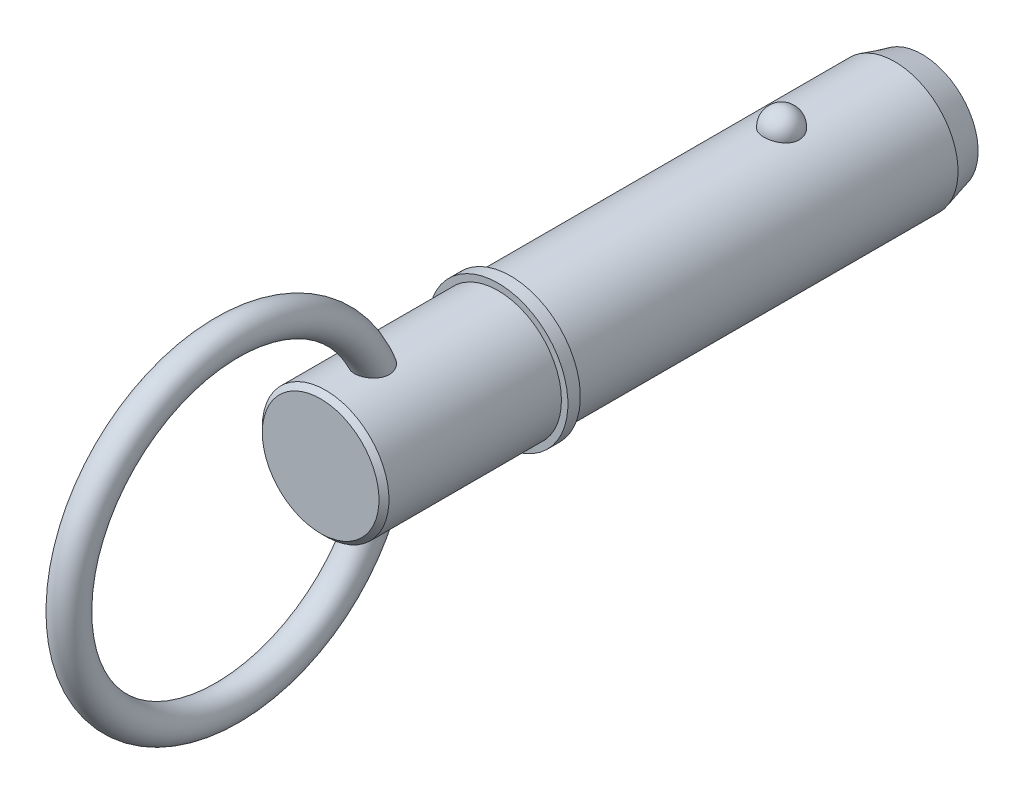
ISO-10303-21;
HEADER;
FILE_DESCRIPTION(('STEP AP214'),'2;1');
FILE_NAME('part.step','',(''),(''),'','','');
FILE_SCHEMA(('AUTOMOTIVE_DESIGN { 1 0 10303 214 1 1 1 1 }'));
ENDSEC;
DATA;
#1=APPLICATION_CONTEXT('core data for automotive mechanical design processes');
#2=APPLICATION_PROTOCOL_DEFINITION('international standard','automotive_design',2000,#1);
#3=PRODUCT_CONTEXT('',#1,'mechanical');
#4=PRODUCT('Part','Part','',(#3));
#5=PRODUCT_RELATED_PRODUCT_CATEGORY('part','',(#4));
#6=PRODUCT_DEFINITION_FORMATION('','',#4);
#7=PRODUCT_DEFINITION_CONTEXT('part definition',#1,'design');
#8=PRODUCT_DEFINITION('design','',#6,#7);
#9=PRODUCT_DEFINITION_SHAPE('','',#8);
#10=(LENGTH_UNIT() NAMED_UNIT(*) SI_UNIT(.MILLI.,.METRE.));
#11=(NAMED_UNIT(*) PLANE_ANGLE_UNIT() SI_UNIT($,.RADIAN.));
#12=(NAMED_UNIT(*) SI_UNIT($,.STERADIAN.) SOLID_ANGLE_UNIT());
#13=UNCERTAINTY_MEASURE_WITH_UNIT(LENGTH_MEASURE(1.E-05),#10,'distance_accuracy_value','');
#14=(GEOMETRIC_REPRESENTATION_CONTEXT(3) GLOBAL_UNCERTAINTY_ASSIGNED_CONTEXT((#13)) GLOBAL_UNIT_ASSIGNED_CONTEXT((#10,
#11,#12)) REPRESENTATION_CONTEXT('',''));
#15=CARTESIAN_POINT('',(0.,0.,0.));
#16=DIRECTION('',(0.,0.,1.));
#17=DIRECTION('',(1.,0.,0.));
#18=AXIS2_PLACEMENT_3D('',#15,#16,#17);
#19=CARTESIAN_POINT('',(0.,0.,50.8));
#20=DIRECTION('',(0.,0.,-1.));
#21=DIRECTION('',(-1.,0.,0.));
#22=AXIS2_PLACEMENT_3D('',#19,#20,#21);
#23=CYLINDRICAL_SURFACE('',#22,12.7);
#24=CARTESIAN_POINT('',(3.52486003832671,12.2010393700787,-3.56));
#25=CARTESIAN_POINT('',(3.52485671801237,12.2010422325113,-3.3610062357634));
#26=CARTESIAN_POINT('',(3.50863187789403,12.2057632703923,-3.16197042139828));
#27=CARTESIAN_POINT('',(3.4441205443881,12.2241207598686,-2.76953945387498));
#28=CARTESIAN_POINT('',(3.39582213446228,12.2377605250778,-2.57614642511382));
#29=CARTESIAN_POINT('',(3.26839193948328,12.2724057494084,-2.20059799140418));
#30=CARTESIAN_POINT('',(3.18927369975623,12.2934079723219,-2.01843769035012));
#31=CARTESIAN_POINT('',(3.00217139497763,12.3404306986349,-1.6703228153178));
#32=CARTESIAN_POINT('',(2.89418796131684,12.3664510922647,-1.50436788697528));
#33=CARTESIAN_POINT('',(2.65144862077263,12.4207616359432,-1.19241975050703));
#34=CARTESIAN_POINT('',(2.51656310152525,12.4490623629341,-1.04652919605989));
#35=CARTESIAN_POINT('',(2.22383249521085,12.5046678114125,-0.779711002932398));
#36=CARTESIAN_POINT('',(2.0659873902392,12.5319725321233,-0.658783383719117));
#37=CARTESIAN_POINT('',(1.73204520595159,12.5824645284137,-0.445586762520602));
#38=CARTESIAN_POINT('',(1.55600183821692,12.6056634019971,-0.353236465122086));
#39=CARTESIAN_POINT('',(1.19021695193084,12.6454411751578,-0.199381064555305));
#40=CARTESIAN_POINT('',(1.00047694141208,12.6620208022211,-0.137872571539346));
#41=CARTESIAN_POINT('',(0.616329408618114,12.6864692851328,-0.0483191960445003));
#42=CARTESIAN_POINT('',(0.422067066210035,12.6944893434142,-0.0196927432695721));
#43=CARTESIAN_POINT('',(0.0313259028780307,12.7014637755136,0.00524116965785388));
#44=CARTESIAN_POINT('',(-0.165152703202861,12.7004190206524,0.00155173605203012));
#45=CARTESIAN_POINT('',(-0.551780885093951,12.6894611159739,-0.0377454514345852));
#46=CARTESIAN_POINT('',(-0.74198078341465,12.6796749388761,-0.0728962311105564));
#47=CARTESIAN_POINT('',(-1.11361063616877,12.6524544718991,-0.173489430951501));
#48=CARTESIAN_POINT('',(-1.29504043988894,12.6350200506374,-0.238932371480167));
#49=CARTESIAN_POINT('',(-1.64521311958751,12.5942270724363,-0.398772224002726));
#50=CARTESIAN_POINT('',(-1.81387645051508,12.5708347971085,-0.493334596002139));
#51=CARTESIAN_POINT('',(-2.13292959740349,12.5206522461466,-0.708731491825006));
#52=CARTESIAN_POINT('',(-2.28331755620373,12.4938616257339,-0.829568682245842));
#53=CARTESIAN_POINT('',(-2.56470285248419,12.4391828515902,-1.0968714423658));
#54=CARTESIAN_POINT('',(-2.69527522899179,12.4112835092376,-1.24378221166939));
#55=CARTESIAN_POINT('',(-2.93023079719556,12.3579248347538,-1.55763192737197));
#56=CARTESIAN_POINT('',(-3.03461212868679,12.3324656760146,-1.72457229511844));
#57=CARTESIAN_POINT('',(-3.21564423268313,12.2865167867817,-2.07598316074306));
#58=CARTESIAN_POINT('',(-3.29196222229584,12.2660875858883,-2.26063321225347));
#59=CARTESIAN_POINT('',(-3.41323771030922,12.2328979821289,-2.64061334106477));
#60=CARTESIAN_POINT('',(-3.45819611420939,12.2201373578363,-2.83594310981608));
#61=CARTESIAN_POINT('',(-3.51550038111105,12.2037762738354,-3.2308649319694));
#62=CARTESIAN_POINT('',(-3.5279827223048,12.200137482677,-3.43043558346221));
#63=CARTESIAN_POINT('',(-3.52041430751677,12.2023234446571,-3.8289025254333));
#64=CARTESIAN_POINT('',(-3.50036443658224,12.2081479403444,-4.02779883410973));
#65=CARTESIAN_POINT('',(-3.42842010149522,12.2285446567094,-4.41824213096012));
#66=CARTESIAN_POINT('',(-3.37668525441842,12.243073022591,-4.6098208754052));
#67=CARTESIAN_POINT('',(-3.24279085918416,12.2792134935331,-4.98132360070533));
#68=CARTESIAN_POINT('',(-3.16063009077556,12.300825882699,-5.16124711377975));
#69=CARTESIAN_POINT('',(-2.96738224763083,12.3488691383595,-5.50542856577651));
#70=CARTESIAN_POINT('',(-2.85613997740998,12.3753256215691,-5.66959579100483));
#71=CARTESIAN_POINT('',(-2.60773241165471,12.4300386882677,-5.97665065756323));
#72=CARTESIAN_POINT('',(-2.47056612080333,12.458295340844,-6.11953748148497));
#73=CARTESIAN_POINT('',(-2.17327999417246,12.5135827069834,-6.38059312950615));
#74=CARTESIAN_POINT('',(-2.01307652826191,12.5406084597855,-6.49866785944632));
#75=CARTESIAN_POINT('',(-1.67442544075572,12.5902954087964,-6.70609314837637));
#76=CARTESIAN_POINT('',(-1.49597909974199,12.6129569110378,-6.79544572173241));
#77=CARTESIAN_POINT('',(-1.12819666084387,12.6511224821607,-6.94192787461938));
#78=CARTESIAN_POINT('',(-0.93902400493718,12.666712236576,-6.99944518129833));
#79=CARTESIAN_POINT('',(-0.553267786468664,12.6894125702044,-7.08227444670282));
#80=CARTESIAN_POINT('',(-0.356685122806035,12.6965241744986,-7.10759029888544));
#81=CARTESIAN_POINT('',(0.0343320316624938,12.7014305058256,-7.12510946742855));
#82=CARTESIAN_POINT('',(0.228736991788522,12.6993986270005,-7.11792901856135));
#83=CARTESIAN_POINT('',(0.613493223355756,12.6866339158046,-7.07206766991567));
#84=CARTESIAN_POINT('',(0.803844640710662,12.6759013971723,-7.03338790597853));
#85=CARTESIAN_POINT('',(1.17440741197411,12.6469443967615,-6.925834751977));
#86=CARTESIAN_POINT('',(1.35465462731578,12.6287486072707,-6.85707692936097));
#87=CARTESIAN_POINT('',(1.70092526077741,12.5867908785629,-6.69128257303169));
#88=CARTESIAN_POINT('',(1.86694777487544,12.5630285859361,-6.59424424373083));
#89=CARTESIAN_POINT('',(2.18289085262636,12.5120350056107,-6.3727748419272));
#90=CARTESIAN_POINT('',(2.33252391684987,12.4847559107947,-6.24794475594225));
#91=CARTESIAN_POINT('',(2.60889724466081,12.4299457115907,-5.97511730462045));
#92=CARTESIAN_POINT('',(2.73563353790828,12.4024145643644,-5.82711592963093));
#93=CARTESIAN_POINT('',(2.96505559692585,12.3495984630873,-5.5091226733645));
#94=CARTESIAN_POINT('',(3.06728335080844,12.3243610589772,-5.33879227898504));
#95=CARTESIAN_POINT('',(3.24218794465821,12.2795120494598,-4.98295005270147));
#96=CARTESIAN_POINT('',(3.31487538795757,12.2598984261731,-4.79744369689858));
#97=CARTESIAN_POINT('',(3.42255689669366,12.2302435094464,-4.43775244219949));
#98=CARTESIAN_POINT('',(3.46085292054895,12.2193780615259,-4.264615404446));
#99=CARTESIAN_POINT('',(3.5120056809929,12.2047747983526,-3.9143299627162));
#100=CARTESIAN_POINT('',(3.52486299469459,12.2010368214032,-3.73718164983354));
#101=CARTESIAN_POINT('',(3.52486003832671,12.2010393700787,-3.56));
#102=B_SPLINE_CURVE_WITH_KNOTS('',3,(#24,#25,#26,#27,#28,#29,#30,#31,#32,#33,#34,#35,#36,#37,
#38,#39,#40,#41,#42,#43,#44,#45,#46,#47,#48,#49,#50,#51,#52,#53,#54,#55,#56,#57,#58,#59,#60,#61,
#62,#63,#64,#65,#66,#67,#68,#69,#70,#71,#72,#73,#74,#75,#76,#77,#78,#79,#80,#81,#82,#83,#84,#85,
#86,#87,#88,#89,#90,#91,#92,#93,#94,#95,#96,#97,#98,#99,#100,#101),.UNSPECIFIED.,.T.,.F.,(4,2,2,
2,2,2,2,2,2,2,2,2,2,2,2,2,2,2,2,2,2,2,2,2,2,2,2,2,2,2,2,2,2,2,2,2,2,2,4),(0.,0.596344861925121,
1.19291141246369,1.78921606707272,2.38550767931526,2.98474477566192,3.58398233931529,
4.18149920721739,4.77895038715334,5.36566361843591,5.95232045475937,6.53059198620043,
7.10887345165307,7.6905033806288,8.27219236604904,8.86498552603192,9.45782077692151,
10.0574751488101,10.6571122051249,11.2542252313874,11.8513220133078,12.4454353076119,
13.0395724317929,13.636947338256,14.2343451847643,14.8339691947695,15.4335511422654,
16.0256602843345,16.6176978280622,17.1985559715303,17.7793931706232,18.3580179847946,
18.9366795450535,19.5242567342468,20.1119357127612,20.7098642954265,21.3075780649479,
21.8385683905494,22.3695466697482),.UNSPECIFIED.);
#103=CARTESIAN_POINT('',(3.52486003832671,12.2010393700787,-3.56));
#104=VERTEX_POINT('',#103);
#105=EDGE_CURVE('E102',#104,#104,#102,.T.);
#106=ORIENTED_EDGE('',*,*,#105,.T.);
#107=EDGE_LOOP('',(#106));
#108=FACE_BOUND('',#107,.T.);
#109=CARTESIAN_POINT('',(0.,0.,-26.2499999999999));
#110=DIRECTION('',(0.,0.,-1.));
#111=DIRECTION('',(-1.,0.,0.));
#112=AXIS2_PLACEMENT_3D('',#109,#110,#111);
#113=CIRCLE('',#112,12.7);
#114=CARTESIAN_POINT('',(-12.7,0.,-26.2499999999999));
#115=VERTEX_POINT('',#114);
#116=EDGE_CURVE('E110',#115,#115,#113,.F.);
#117=ORIENTED_EDGE('',*,*,#116,.T.);
#118=EDGE_LOOP('',(#117));
#119=FACE_BOUND('',#118,.T.);
#120=CARTESIAN_POINT('',(0.,0.,50.8));
#121=DIRECTION('',(0.,0.,1.));
#122=DIRECTION('',(1.,0.,0.));
#123=AXIS2_PLACEMENT_3D('',#120,#121,#122);
#124=CIRCLE('',#123,12.7);
#125=CARTESIAN_POINT('',(12.7,0.,50.8));
#126=VERTEX_POINT('',#125);
#127=EDGE_CURVE('E108',#126,#126,#124,.T.);
#128=ORIENTED_EDGE('',*,*,#127,.F.);
#129=EDGE_LOOP('',(#128));
#130=FACE_BOUND('',#129,.T.);
#131=ADVANCED_FACE('F39',(#108,#119,#130),#23,.T.);
#132=CARTESIAN_POINT('',(0.,0.,-31.75));
#133=DIRECTION('',(0.,0.,-1.));
#134=DIRECTION('',(-1.,0.,0.));
#135=AXIS2_PLACEMENT_3D('',#132,#133,#134);
#136=PLANE('',#135);
#137=CARTESIAN_POINT('',(0.,0.,-31.75));
#138=DIRECTION('',(0.,0.,-1.));
#139=DIRECTION('',(-1.,0.,0.));
#140=AXIS2_PLACEMENT_3D('',#137,#138,#139);
#141=CIRCLE('',#140,11.2262794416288);
#142=CARTESIAN_POINT('',(-11.2262794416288,0.,-31.75));
#143=VERTEX_POINT('',#142);
#144=EDGE_CURVE('E142',#143,#143,#141,.T.);
#145=ORIENTED_EDGE('',*,*,#144,.T.);
#146=EDGE_LOOP('',(#145));
#147=FACE_BOUND('',#146,.T.);
#148=ADVANCED_FACE('F88',(#147),#136,.T.);
#149=CARTESIAN_POINT('',(0.,0.,-31.75));
#150=DIRECTION('',(0.,0.,1.));
#151=DIRECTION('',(1.,0.,0.));
#152=AXIS2_PLACEMENT_3D('',#149,#150,#151);
#153=CONICAL_SURFACE('',#152,11.2262794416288,0.261799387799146);
#154=ORIENTED_EDGE('',*,*,#116,.F.);
#155=EDGE_LOOP('',(#154));
#156=FACE_BOUND('',#155,.T.);
#157=ORIENTED_EDGE('',*,*,#144,.F.);
#158=EDGE_LOOP('',(#157));
#159=FACE_BOUND('',#158,.T.);
#160=ADVANCED_FACE('F94',(#156,#159),#153,.T.);
#161=CARTESIAN_POINT('',(0.,12.7,-3.56));
#162=DIRECTION('',(0.,1.,0.));
#163=DIRECTION('',(0.,0.,1.));
#164=AXIS2_PLACEMENT_3D('',#161,#162,#163);
#165=SPHERICAL_SURFACE('',#164,3.56);
#166=ORIENTED_EDGE('',*,*,#105,.F.);
#167=EDGE_LOOP('',(#166));
#168=FACE_BOUND('',#167,.T.);
#169=ADVANCED_FACE('F113',(#168),#165,.T.);
#170=CARTESIAN_POINT('',(0.,0.,50.8));
#171=DIRECTION('',(0.,0.,-1.));
#172=DIRECTION('',(-1.,0.,0.));
#173=AXIS2_PLACEMENT_3D('',#170,#171,#172);
#174=PLANE('',#173);
#175=ORIENTED_EDGE('',*,*,#127,.T.);
#176=EDGE_LOOP('',(#175));
#177=FACE_BOUND('',#176,.T.);
#178=CARTESIAN_POINT('',(0.,0.,50.8));
#179=DIRECTION('',(0.,0.,-1.));
#180=DIRECTION('',(-1.,0.,0.));
#181=AXIS2_PLACEMENT_3D('',#178,#179,#180);
#182=CIRCLE('',#181,14.);
#183=CARTESIAN_POINT('',(-14.,0.,50.8));
#184=VERTEX_POINT('',#183);
#185=EDGE_CURVE('E109',#184,#184,#182,.T.);
#186=ORIENTED_EDGE('',*,*,#185,.T.);
#187=EDGE_LOOP('',(#186));
#188=FACE_BOUND('',#187,.T.);
#189=ADVANCED_FACE('F117',(#177,#188),#174,.T.);
#190=CARTESIAN_POINT('',(0.,0.,33.7287874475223));
#191=DIRECTION('',(0.,0.,-1.));
#192=DIRECTION('',(-1.,0.,0.));
#193=AXIS2_PLACEMENT_3D('',#190,#191,#192);
#194=CYLINDRICAL_SURFACE('',#193,14.);
#195=CARTESIAN_POINT('',(0.,0.,53.3));
#196=DIRECTION('',(0.,0.,-1.));
#197=DIRECTION('',(-1.,0.,0.));
#198=AXIS2_PLACEMENT_3D('',#195,#196,#197);
#199=CIRCLE('',#198,14.);
#200=CARTESIAN_POINT('',(-14.,0.,53.3));
#201=VERTEX_POINT('',#200);
#202=EDGE_CURVE('E134',#201,#201,#199,.T.);
#203=ORIENTED_EDGE('',*,*,#202,.T.);
#204=EDGE_LOOP('',(#203));
#205=FACE_BOUND('',#204,.T.);
#206=ORIENTED_EDGE('',*,*,#185,.F.);
#207=EDGE_LOOP('',(#206));
#208=FACE_BOUND('',#207,.T.);
#209=ADVANCED_FACE('F121',(#205,#208),#194,.T.);
#210=CARTESIAN_POINT('',(0.,14.,53.3));
#211=DIRECTION('',(0.,0.,1.));
#212=DIRECTION('',(1.,0.,0.));
#213=AXIS2_PLACEMENT_3D('',#210,#211,#212);
#214=PLANE('',#213);
#215=CARTESIAN_POINT('',(0.,0.,53.3));
#216=DIRECTION('',(0.,0.,1.));
#217=DIRECTION('',(1.,0.,0.));
#218=AXIS2_PLACEMENT_3D('',#215,#216,#217);
#219=CIRCLE('',#218,12.7);
#220=CARTESIAN_POINT('',(12.7,0.,53.3));
#221=VERTEX_POINT('',#220);
#222=EDGE_CURVE('E112',#221,#221,#219,.T.);
#223=ORIENTED_EDGE('',*,*,#222,.F.);
#224=EDGE_LOOP('',(#223));
#225=FACE_BOUND('',#224,.T.);
#226=ORIENTED_EDGE('',*,*,#202,.F.);
#227=EDGE_LOOP('',(#226));
#228=FACE_BOUND('',#227,.T.);
#229=ADVANCED_FACE('F85',(#225,#228),#214,.T.);
#230=CARTESIAN_POINT('',(0.,0.,88.9));
#231=DIRECTION('',(0.,0.,-1.));
#232=DIRECTION('',(-1.,0.,0.));
#233=AXIS2_PLACEMENT_3D('',#230,#231,#232);
#234=CYLINDRICAL_SURFACE('',#233,12.7);
#235=CARTESIAN_POINT('',(-1.22892607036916,-12.6404011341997,75.2711939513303));
#236=CARTESIAN_POINT('',(-1.06119922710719,-12.6567092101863,75.2040042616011));
#237=CARTESIAN_POINT('',(-0.887663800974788,-12.6701810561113,75.1507925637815));
#238=CARTESIAN_POINT('',(-0.533823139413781,-12.6900116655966,75.0734192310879));
#239=CARTESIAN_POINT('',(-0.353518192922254,-12.6963707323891,75.0492563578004));
#240=CARTESIAN_POINT('',(0.00871153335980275,-12.7012887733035,75.0305190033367));
#241=CARTESIAN_POINT('',(0.190636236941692,-12.699848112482,75.0359431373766));
#242=CARTESIAN_POINT('',(0.550971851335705,-12.6893231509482,75.0762551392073));
#243=CARTESIAN_POINT('',(0.729382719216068,-12.6802387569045,75.1111433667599));
#244=CARTESIAN_POINT('',(1.07771687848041,-12.6553960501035,75.2096598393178));
#245=CARTESIAN_POINT('',(1.24763507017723,-12.6396337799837,75.273305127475));
#246=CARTESIAN_POINT('',(1.57398922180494,-12.6031560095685,75.4278916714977));
#247=CARTESIAN_POINT('',(1.73042571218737,-12.5824407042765,75.5188318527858));
#248=CARTESIAN_POINT('',(2.02464767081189,-12.5384554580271,75.7253206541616));
#249=CARTESIAN_POINT('',(2.16251370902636,-12.5151974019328,75.8407569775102));
#250=CARTESIAN_POINT('',(2.41652917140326,-12.4686447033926,76.0934261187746));
#251=CARTESIAN_POINT('',(2.53268123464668,-12.4453500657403,76.230656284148));
#252=CARTESIAN_POINT('',(2.7397169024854,-12.4014166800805,76.5222617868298));
#253=CARTESIAN_POINT('',(2.83072997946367,-12.3807646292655,76.6765433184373));
#254=CARTESIAN_POINT('',(2.98642630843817,-12.3441356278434,76.998338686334));
#255=CARTESIAN_POINT('',(3.05110876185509,-12.3281588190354,77.1658529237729));
#256=CARTESIAN_POINT('',(3.15450336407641,-12.3021148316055,77.5127059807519));
#257=CARTESIAN_POINT('',(3.19268116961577,-12.2921697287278,77.6922122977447));
#258=CARTESIAN_POINT('',(3.24150148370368,-12.2793848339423,78.0551447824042));
#259=CARTESIAN_POINT('',(3.25213515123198,-12.2765473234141,78.2385721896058));
#260=CARTESIAN_POINT('',(3.24696781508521,-12.2779158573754,78.6188932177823));
#261=CARTESIAN_POINT('',(3.22910261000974,-12.2826719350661,78.8157539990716));
#262=CARTESIAN_POINT('',(3.16504953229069,-12.2993299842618,79.2044791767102));
#263=CARTESIAN_POINT('',(3.11884966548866,-12.3112349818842,79.3963414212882));
#264=CARTESIAN_POINT('',(2.99323123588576,-12.3424162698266,79.7928913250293));
#265=CARTESIAN_POINT('',(2.91059577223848,-12.3623844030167,79.9965057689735));
#266=CARTESIAN_POINT('',(2.71447440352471,-12.4069229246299,80.3881909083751));
#267=CARTESIAN_POINT('',(2.60094970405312,-12.431499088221,80.5762416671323));
#268=CARTESIAN_POINT('',(2.40499526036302,-12.4703951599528,80.8474701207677));
#269=CARTESIAN_POINT('',(2.3330184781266,-12.4841083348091,80.9384072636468));
#270=CARTESIAN_POINT('',(2.18106597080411,-12.5115521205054,81.1133206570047));
#271=CARTESIAN_POINT('',(2.10108885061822,-12.5252827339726,81.1972956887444));
#272=CARTESIAN_POINT('',(1.8497396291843,-12.5657115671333,81.4367795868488));
#273=CARTESIAN_POINT('',(1.6664677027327,-12.5917488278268,81.5805264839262));
#274=CARTESIAN_POINT('',(1.33551340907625,-12.6303067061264,81.7858562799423));
#275=CARTESIAN_POINT('',(1.19512135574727,-12.6444898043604,81.8590224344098));
#276=CARTESIAN_POINT('',(0.903945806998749,-12.6686276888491,81.9815868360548));
#277=CARTESIAN_POINT('',(0.7531733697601,-12.6785868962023,82.0310099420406));
#278=CARTESIAN_POINT('',(0.444090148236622,-12.6931800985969,82.1029423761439));
#279=CARTESIAN_POINT('',(0.285741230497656,-12.6977833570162,82.1252963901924));
#280=CARTESIAN_POINT('',(-0.0324491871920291,-12.700953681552,82.1407247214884));
#281=CARTESIAN_POINT('',(-0.192290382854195,-12.6995219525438,82.1338048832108));
#282=CARTESIAN_POINT('',(-0.49382263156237,-12.6912132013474,82.0932090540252));
#283=CARTESIAN_POINT('',(-0.635865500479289,-12.6848307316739,82.0619622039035));
#284=CARTESIAN_POINT('',(-0.913041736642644,-12.6678986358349,81.9777216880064));
#285=CARTESIAN_POINT('',(-1.0481734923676,-12.6573480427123,81.9247229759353));
#286=CARTESIAN_POINT('',(-1.31637898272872,-12.6323524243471,81.7962339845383));
#287=CARTESIAN_POINT('',(-1.44890088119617,-12.6177203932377,81.7196381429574));
#288=CARTESIAN_POINT('',(-1.70162176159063,-12.5861326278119,81.5487430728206));
#289=CARTESIAN_POINT('',(-1.82181486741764,-12.569175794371,81.4544354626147));
#290=CARTESIAN_POINT('',(-2.06961284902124,-12.5309682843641,81.2326655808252));
#291=CARTESIAN_POINT('',(-2.19457628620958,-12.5094982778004,81.1022933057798));
#292=CARTESIAN_POINT('',(-2.42503767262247,-12.4668738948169,80.8253083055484));
#293=CARTESIAN_POINT('',(-2.53052086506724,-12.4457197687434,80.6786834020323));
#294=CARTESIAN_POINT('',(-2.7396115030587,-12.4015349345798,80.343065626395));
#295=CARTESIAN_POINT('',(-2.83895917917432,-12.3789253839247,80.1513469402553));
#296=CARTESIAN_POINT('',(-3.00725804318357,-12.3391195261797,79.7544056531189));
#297=CARTESIAN_POINT('',(-3.07618857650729,-12.3219268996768,79.5491739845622));
#298=CARTESIAN_POINT('',(-3.18528660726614,-12.2942052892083,79.1137546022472));
#299=CARTESIAN_POINT('',(-3.22287145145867,-12.2842816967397,78.8828554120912));
#300=CARTESIAN_POINT('',(-3.24821271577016,-12.2775854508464,78.5343510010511));
#301=CARTESIAN_POINT('',(-3.2514823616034,-12.276719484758,78.417777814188));
#302=CARTESIAN_POINT('',(-3.24729041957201,-12.2778310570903,78.1848590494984));
#303=CARTESIAN_POINT('',(-3.23983534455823,-12.2798068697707,78.0685133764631));
#304=CARTESIAN_POINT('',(-3.21488959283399,-12.286359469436,77.84622762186));
#305=CARTESIAN_POINT('',(-3.19823165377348,-12.2907201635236,77.7401869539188));
#306=CARTESIAN_POINT('',(-3.15537465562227,-12.3017926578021,77.5302225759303));
#307=CARTESIAN_POINT('',(-3.12918076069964,-12.3085031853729,77.4262977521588));
#308=CARTESIAN_POINT('',(-3.06721568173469,-12.3240904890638,77.2215537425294));
#309=CARTESIAN_POINT('',(-3.03144854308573,-12.3329663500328,77.1207332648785));
#310=CARTESIAN_POINT('',(-2.95042598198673,-12.3525998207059,76.9231715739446));
#311=CARTESIAN_POINT('',(-2.90517160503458,-12.3633572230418,76.8264299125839));
#312=CARTESIAN_POINT('',(-2.81116315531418,-12.3850478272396,76.6488579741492));
#313=CARTESIAN_POINT('',(-2.76340897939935,-12.3958187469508,76.5674768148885));
#314=CARTESIAN_POINT('',(-2.66091958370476,-12.4182228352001,76.4093176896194));
#315=CARTESIAN_POINT('',(-2.60618212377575,-12.4298562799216,76.3325412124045));
#316=CARTESIAN_POINT('',(-2.49013138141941,-12.4536239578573,76.1842781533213));
#317=CARTESIAN_POINT('',(-2.4288215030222,-12.4657579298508,76.1127888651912));
#318=CARTESIAN_POINT('',(-2.30002146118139,-12.4901640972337,75.9755874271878));
#319=CARTESIAN_POINT('',(-2.23252894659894,-12.5024363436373,75.9098774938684));
#320=CARTESIAN_POINT('',(-2.09370795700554,-12.5264205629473,75.7863775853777));
#321=CARTESIAN_POINT('',(-2.02252382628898,-12.5381388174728,75.7284267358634));
#322=CARTESIAN_POINT('',(-1.87531735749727,-12.5610012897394,75.6188912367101));
#323=CARTESIAN_POINT('',(-1.79929316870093,-12.5721452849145,75.5673090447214));
#324=CARTESIAN_POINT('',(-1.5648528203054,-12.6042047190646,75.4227065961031));
#325=CARTESIAN_POINT('',(-1.39990754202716,-12.6237766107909,75.3396874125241));
#326=CARTESIAN_POINT('',(-1.22892607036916,-12.6404011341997,75.2711939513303));
#327=B_SPLINE_CURVE_WITH_KNOTS('',3,(#235,#236,#237,#238,#239,#240,#241,#242,#243,#244,#245,
#246,#247,#248,#249,#250,#251,#252,#253,#254,#255,#256,#257,#258,#259,#260,#261,#262,#263,#264,
#265,#266,#267,#268,#269,#270,#271,#272,#273,#274,#275,#276,#277,#278,#279,#280,#281,#282,#283,
#284,#285,#286,#287,#288,#289,#290,#291,#292,#293,#294,#295,#296,#297,#298,#299,#300,#301,#302,
#303,#304,#305,#306,#307,#308,#309,#310,#311,#312,#313,#314,#315,#316,#317,#318,#319,#320,#321,
#322,#323,#324,#325,#326),.UNSPECIFIED.,.T.,.F.,(4,2,2,2,2,2,2,2,2,2,2,2,2,2,2,2,2,2,2,2,2,2,2,
2,2,2,2,2,2,2,2,2,2,2,2,2,2,2,2,2,2,2,2,2,2,4),(0.,0.543509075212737,1.08699497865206,
1.63045544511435,2.17392254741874,2.71771216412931,3.26148037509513,3.80280767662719,
4.34406914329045,4.88248866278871,5.42092451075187,5.96992270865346,6.51909710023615,
7.10988630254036,7.70092576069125,8.36013748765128,9.02018098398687,9.37009147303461,
9.72006308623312,10.4175255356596,10.8925536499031,11.3670833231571,11.844322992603,
12.3214673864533,12.7562647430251,13.1911630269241,13.6507378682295,14.1105307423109,
14.6541210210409,15.198121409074,15.8467121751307,16.4957426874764,17.1940750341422,
17.5435132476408,17.8927393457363,18.2145822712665,18.5362511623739,18.8577843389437,
19.1792821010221,19.4638320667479,19.7484735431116,20.0329683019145,20.3175717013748,
20.5948148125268,20.8721645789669,21.4262200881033),.UNSPECIFIED.);
#328=CARTESIAN_POINT('',(-1.22892607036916,-12.6404011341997,75.2711939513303));
#329=VERTEX_POINT('',#328);
#330=EDGE_CURVE('E10',#329,#329,#327,.T.);
#331=ORIENTED_EDGE('',*,*,#330,.F.);
#332=EDGE_LOOP('',(#331));
#333=FACE_BOUND('',#332,.T.);
#334=CARTESIAN_POINT('',(-1.22892607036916,12.6404011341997,75.2711939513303));
#335=CARTESIAN_POINT('',(-1.39512541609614,12.624240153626,75.33776712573));
#336=CARTESIAN_POINT('',(-1.55582432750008,12.6052778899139,75.4181538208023));
#337=CARTESIAN_POINT('',(-1.86136954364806,12.5638060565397,75.6046587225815));
#338=CARTESIAN_POINT('',(-2.00617769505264,12.5412882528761,75.7108369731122));
#339=CARTESIAN_POINT('',(-2.27547906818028,12.4952333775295,75.9461035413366));
#340=CARTESIAN_POINT('',(-2.39998742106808,12.4716970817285,76.0751746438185));
#341=CARTESIAN_POINT('',(-2.62534229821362,12.4262157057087,76.3526236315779));
#342=CARTESIAN_POINT('',(-2.72620384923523,12.4042696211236,76.5009891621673));
#343=CARTESIAN_POINT('',(-2.90197976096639,12.3643304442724,76.8126750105));
#344=CARTESIAN_POINT('',(-2.97691335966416,12.3463344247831,76.9759841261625));
#345=CARTESIAN_POINT('',(-3.09983588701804,12.3160482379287,77.3129272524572));
#346=CARTESIAN_POINT('',(-3.14781852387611,12.3037594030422,77.486563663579));
#347=CARTESIAN_POINT('',(-3.21809353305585,12.2855709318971,77.8455239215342));
#348=CARTESIAN_POINT('',(-3.23943500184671,12.2799082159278,78.031044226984));
#349=CARTESIAN_POINT('',(-3.2544382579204,12.2759385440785,78.4032324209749));
#350=CARTESIAN_POINT('',(-3.24809142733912,12.2776338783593,78.589900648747));
#351=CARTESIAN_POINT('',(-3.20755159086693,12.288291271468,78.9775770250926));
#352=CARTESIAN_POINT('',(-3.17081691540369,12.2979162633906,79.178299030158));
#353=CARTESIAN_POINT('',(-3.06845850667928,12.3238513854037,79.5718580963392));
#354=CARTESIAN_POINT('',(-3.00281105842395,12.3401670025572,79.7646885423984));
#355=CARTESIAN_POINT('',(-2.83560995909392,12.3797223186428,80.1594732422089));
#356=CARTESIAN_POINT('',(-2.73085133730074,12.4035339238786,80.3600192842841));
#357=CARTESIAN_POINT('',(-2.48976141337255,12.4541651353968,80.7408130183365));
#358=CARTESIAN_POINT('',(-2.35343772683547,12.4809840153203,80.9210655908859));
#359=CARTESIAN_POINT('',(-2.07683984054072,12.5296806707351,81.2256599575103));
#360=CARTESIAN_POINT('',(-1.94129351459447,12.551613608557,81.3542839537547));
#361=CARTESIAN_POINT('',(-1.65081707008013,12.5931023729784,81.5878364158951));
#362=CARTESIAN_POINT('',(-1.49591505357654,12.6126615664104,81.6927986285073));
#363=CARTESIAN_POINT('',(-1.19690065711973,12.6442092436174,81.8577889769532));
#364=CARTESIAN_POINT('',(-1.05541267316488,12.6569190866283,81.9224184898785));
#365=CARTESIAN_POINT('',(-0.763415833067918,12.6778764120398,82.0276387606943));
#366=CARTESIAN_POINT('',(-0.612913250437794,12.6861269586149,82.0682460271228));
#367=CARTESIAN_POINT('',(-0.306168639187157,12.697239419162,82.1227152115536));
#368=CARTESIAN_POINT('',(-0.149903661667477,12.7000767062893,82.1364549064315));
#369=CARTESIAN_POINT('',(0.162552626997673,12.699920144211,82.1356942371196));
#370=CARTESIAN_POINT('',(0.318743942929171,12.6969267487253,82.121196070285));
#371=CARTESIAN_POINT('',(0.614555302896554,12.6859231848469,82.0672341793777));
#372=CARTESIAN_POINT('',(0.754548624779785,12.6782987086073,82.0296876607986));
#373=CARTESIAN_POINT('',(1.02685044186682,12.6591561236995,81.9337115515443));
#374=CARTESIAN_POINT('',(1.15915690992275,12.6476369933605,81.8752764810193));
#375=CARTESIAN_POINT('',(1.42405861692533,12.6206654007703,81.7349885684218));
#376=CARTESIAN_POINT('',(1.55582877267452,12.604971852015,81.6516353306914));
#377=CARTESIAN_POINT('',(1.80621935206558,12.571537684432,81.4674980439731));
#378=CARTESIAN_POINT('',(1.92483289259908,12.5537960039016,81.3667049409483));
#379=CARTESIAN_POINT('',(2.16936918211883,12.5140714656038,81.1301745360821));
#380=CARTESIAN_POINT('',(2.29236422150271,12.4919255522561,80.9914396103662));
#381=CARTESIAN_POINT('',(2.51762485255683,12.4484835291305,80.6979131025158));
#382=CARTESIAN_POINT('',(2.61987416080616,12.4271880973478,80.5431090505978));
#383=CARTESIAN_POINT('',(2.81956306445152,12.3835520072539,80.1913163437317));
#384=CARTESIAN_POINT('',(2.91268031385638,12.3617361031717,79.991798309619));
#385=CARTESIAN_POINT('',(3.06675738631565,12.3244204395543,79.5798981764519));
#386=CARTESIAN_POINT('',(3.12769905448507,12.3089242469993,79.3675088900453));
#387=CARTESIAN_POINT('',(3.19410612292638,12.2917937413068,79.0377293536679));
#388=CARTESIAN_POINT('',(3.21217746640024,12.2870696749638,78.9229179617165));
#389=CARTESIAN_POINT('',(3.23822570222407,12.2802317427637,78.6920954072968));
#390=CARTESIAN_POINT('',(3.24620727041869,12.2781166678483,78.5760848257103));
#391=CARTESIAN_POINT('',(3.25166839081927,12.2766712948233,78.3438104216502));
#392=CARTESIAN_POINT('',(3.24914931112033,12.2773406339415,78.2275466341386));
#393=CARTESIAN_POINT('',(3.23325304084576,12.2815367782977,77.9958693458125));
#394=CARTESIAN_POINT('',(3.2198826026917,12.2850618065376,77.8804553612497));
#395=CARTESIAN_POINT('',(3.18378347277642,12.2944635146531,77.662188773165));
#396=CARTESIAN_POINT('',(3.16203615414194,12.3000921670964,77.5591627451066));
#397=CARTESIAN_POINT('',(3.109310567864,12.3135262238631,77.3556941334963));
#398=CARTESIAN_POINT('',(3.07833729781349,12.3213304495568,77.25525018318));
#399=CARTESIAN_POINT('',(3.00719503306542,12.3388864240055,77.0578823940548));
#400=CARTESIAN_POINT('',(2.96702904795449,12.34863753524,76.9609574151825));
#401=CARTESIAN_POINT('',(2.87766260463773,12.3697681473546,76.7715530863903));
#402=CARTESIAN_POINT('',(2.82846300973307,12.3811474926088,76.679073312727));
#403=CARTESIAN_POINT('',(2.72718770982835,12.4038233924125,76.5092787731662));
#404=CARTESIAN_POINT('',(2.67601025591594,12.4149937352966,76.4314098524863));
#405=CARTESIAN_POINT('',(2.56702778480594,12.4379850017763,76.2805146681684));
#406=CARTESIAN_POINT('',(2.50922051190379,12.4498061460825,76.207490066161));
#407=CARTESIAN_POINT('',(2.38741431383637,12.4737362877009,76.0669157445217));
#408=CARTESIAN_POINT('',(2.32341881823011,12.4858451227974,75.9993630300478));
#409=CARTESIAN_POINT('',(2.18967865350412,12.5099935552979,75.8701830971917));
#410=CARTESIAN_POINT('',(2.11993188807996,12.5220331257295,75.8085580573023));
#411=CARTESIAN_POINT('',(1.90863625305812,12.5565453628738,75.6379714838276));
#412=CARTESIAN_POINT('',(1.75996750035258,12.5784460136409,75.5375080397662));
#413=CARTESIAN_POINT('',(1.44761854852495,12.6182083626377,75.3627484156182));
#414=CARTESIAN_POINT('',(1.28394037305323,12.6360706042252,75.2884487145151));
#415=CARTESIAN_POINT('',(0.945887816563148,12.6658634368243,75.1675372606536));
#416=CARTESIAN_POINT('',(0.771499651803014,12.6777861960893,75.120962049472));
#417=CARTESIAN_POINT('',(0.417041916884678,12.694390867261,75.0566734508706));
#418=CARTESIAN_POINT('',(0.236969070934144,12.6990685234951,75.0389770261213));
#419=CARTESIAN_POINT('',(-0.12487967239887,12.7006841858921,75.0328291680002));
#420=CARTESIAN_POINT('',(-0.30665891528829,12.6975703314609,75.0445736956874));
#421=CARTESIAN_POINT('',(-0.665297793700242,12.6838264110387,75.0974733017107));
#422=CARTESIAN_POINT('',(-0.842168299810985,12.6732146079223,75.1385569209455));
#423=CARTESIAN_POINT('',(-1.05025519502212,12.6565519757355,75.205394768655));
#424=CARTESIAN_POINT('',(-1.08632235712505,12.6535053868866,75.2176815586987));
#425=CARTESIAN_POINT('',(-1.15798463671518,12.6471484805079,75.2435019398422));
#426=CARTESIAN_POINT('',(-1.19357974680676,12.643838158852,75.2570355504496));
#427=CARTESIAN_POINT('',(-1.22892607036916,12.6404011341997,75.2711939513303));
#428=B_SPLINE_CURVE_WITH_KNOTS('',3,(#334,#335,#336,#337,#338,#339,#340,#341,#342,#343,#344,
#345,#346,#347,#348,#349,#350,#351,#352,#353,#354,#355,#356,#357,#358,#359,#360,#361,#362,#363,
#364,#365,#366,#367,#368,#369,#370,#371,#372,#373,#374,#375,#376,#377,#378,#379,#380,#381,#382,
#383,#384,#385,#386,#387,#388,#389,#390,#391,#392,#393,#394,#395,#396,#397,#398,#399,#400,#401,
#402,#403,#404,#405,#406,#407,#408,#409,#410,#411,#412,#413,#414,#415,#416,#417,#418,#419,#420,
#421,#422,#423,#424,#425,#426,#427),.UNSPECIFIED.,.T.,.F.,(4,2,2,2,2,2,2,2,2,2,2,2,2,2,2,2,2,2,
2,2,2,2,2,2,2,2,2,2,2,2,2,2,2,2,2,2,2,2,2,2,2,2,2,2,2,2,4),(0.,0.53914655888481,
1.07956050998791,1.61956978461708,2.15923496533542,2.69849886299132,3.23788860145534,
3.79602631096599,4.3543377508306,4.96471598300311,5.57559579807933,6.25509482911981,
6.93443009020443,7.49671429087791,8.05819140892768,8.52445959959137,8.99040698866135,
9.45846913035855,9.92649485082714,10.3600530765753,10.7937251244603,11.2621204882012,
11.7307597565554,12.2888675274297,12.8474116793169,13.5084064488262,14.1697737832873,
14.5183408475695,14.8667463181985,15.2151063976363,15.5632498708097,15.8791508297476,
16.1948809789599,16.5105079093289,16.826104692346,17.1072964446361,17.3885841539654,
17.669716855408,17.9509524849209,18.4904482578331,19.0298713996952,19.5700039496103,
20.1104536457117,20.6545101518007,21.1972460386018,21.3119068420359,21.4265694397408),.UNSPECIFIED.);
#429=CARTESIAN_POINT('',(-1.22892607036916,12.6404011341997,75.2711939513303));
#430=VERTEX_POINT('',#429);
#431=EDGE_CURVE('E51',#430,#430,#428,.T.);
#432=ORIENTED_EDGE('',*,*,#431,.F.);
#433=EDGE_LOOP('',(#432));
#434=FACE_BOUND('',#433,.T.);
#435=CARTESIAN_POINT('',(0.,0.,87.8999999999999));
#436=DIRECTION('',(0.,0.,-1.));
#437=DIRECTION('',(-1.,0.,0.));
#438=AXIS2_PLACEMENT_3D('',#435,#436,#437);
#439=CIRCLE('',#438,12.7);
#440=CARTESIAN_POINT('',(-12.7,0.,87.8999999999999));
#441=VERTEX_POINT('',#440);
#442=EDGE_CURVE('E64',#441,#441,#439,.T.);
#443=ORIENTED_EDGE('',*,*,#442,.T.);
#444=EDGE_LOOP('',(#443));
#445=FACE_BOUND('',#444,.T.);
#446=ORIENTED_EDGE('',*,*,#222,.T.);
#447=EDGE_LOOP('',(#446));
#448=FACE_BOUND('',#447,.T.);
#449=ADVANCED_FACE('F69',(#333,#434,#445,#448),#234,.T.);
#450=CARTESIAN_POINT('',(0.,0.,88.9));
#451=DIRECTION('',(0.,0.,-1.));
#452=DIRECTION('',(-1.,0.,0.));
#453=AXIS2_PLACEMENT_3D('',#450,#451,#452);
#454=PLANE('',#453);
#455=CARTESIAN_POINT('',(0.,0.,88.9));
#456=DIRECTION('',(0.,0.,-1.));
#457=DIRECTION('',(-1.,0.,0.));
#458=AXIS2_PLACEMENT_3D('',#455,#456,#457);
#459=CIRCLE('',#458,11.6999999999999);
#460=CARTESIAN_POINT('',(-11.6999999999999,0.,88.9));
#461=VERTEX_POINT('',#460);
#462=EDGE_CURVE('E58',#461,#461,#459,.F.);
#463=ORIENTED_EDGE('',*,*,#462,.T.);
#464=EDGE_LOOP('',(#463));
#465=FACE_BOUND('',#464,.T.);
#466=ADVANCED_FACE('F76',(#465),#454,.F.);
#467=CARTESIAN_POINT('',(0.,0.,87.8999999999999));
#468=DIRECTION('',(0.,0.,-1.));
#469=DIRECTION('',(-1.,0.,0.));
#470=AXIS2_PLACEMENT_3D('',#467,#468,#469);
#471=CONICAL_SURFACE('',#470,12.7,0.785398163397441);
#472=ORIENTED_EDGE('',*,*,#462,.F.);
#473=EDGE_LOOP('',(#472));
#474=FACE_BOUND('',#473,.T.);
#475=ORIENTED_EDGE('',*,*,#442,.F.);
#476=EDGE_LOOP('',(#475));
#477=FACE_BOUND('',#476,.T.);
#478=ADVANCED_FACE('F41',(#474,#477),#471,.T.);
#479=CARTESIAN_POINT('',(0.,0.,107.65));
#480=DIRECTION('',(1.,0.,0.));
#481=DIRECTION('',(0.,0.,-1.));
#482=AXIS2_PLACEMENT_3D('',#479,#480,#481);
#483=TOROIDAL_SURFACE('',#482,31.75,3.25);
#484=ORIENTED_EDGE('',*,*,#330,.T.);
#485=EDGE_LOOP('',(#484));
#486=FACE_BOUND('',#485,.T.);
#487=ORIENTED_EDGE('',*,*,#431,.T.);
#488=EDGE_LOOP('',(#487));
#489=FACE_BOUND('',#488,.T.);
#490=ADVANCED_FACE('F73',(#486,#489),#483,.T.);
#491=CLOSED_SHELL('',(#131,#148,#160,#169,#189,#209,#229,#449,#466,#478,#490));
#492=MANIFOLD_SOLID_BREP('B2',#491);
#493=ADVANCED_BREP_SHAPE_REPRESENTATION('',(#18,#492),#14);
#494=SHAPE_DEFINITION_REPRESENTATION(#9,#493);
ENDSEC;
END-ISO-10303-21;
